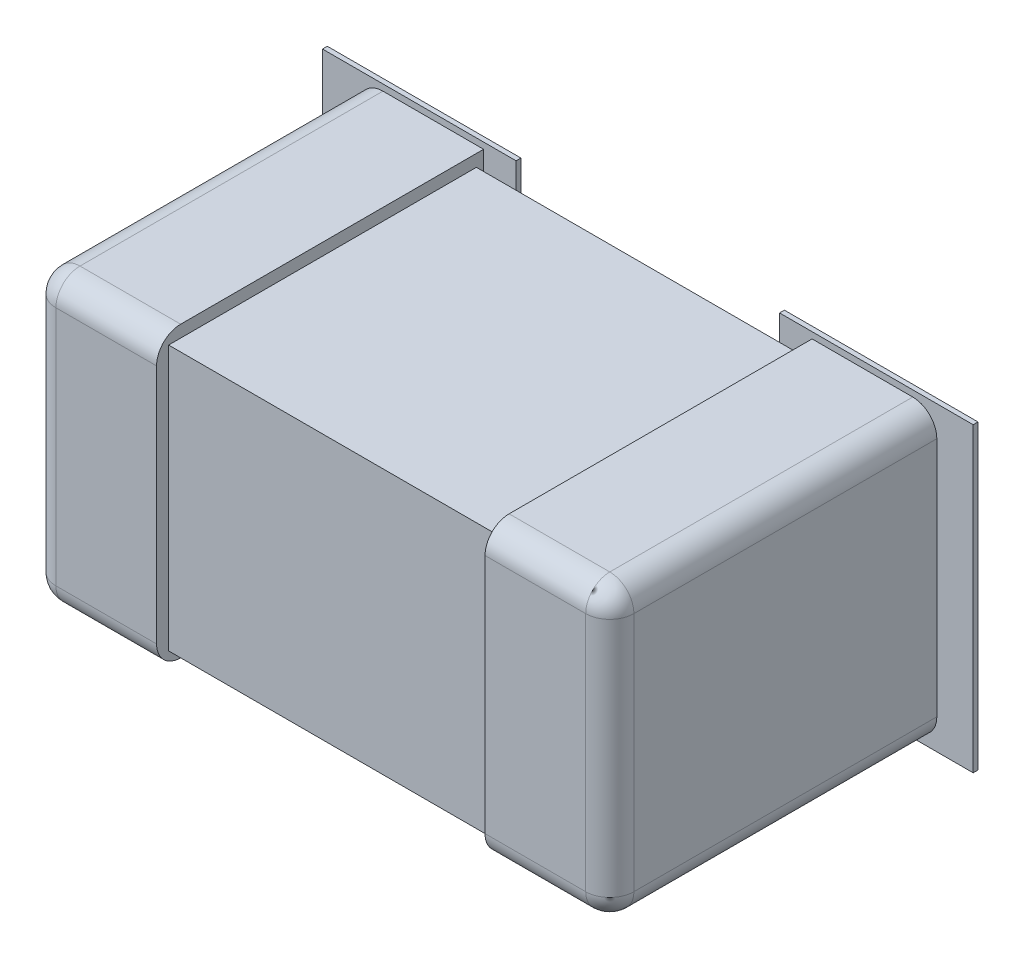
ISO-10303-21;
HEADER;
FILE_DESCRIPTION(('STEP AP214'),'2;1');
FILE_NAME('part.step','',(''),(''),'','','');
FILE_SCHEMA(('AUTOMOTIVE_DESIGN { 1 0 10303 214 1 1 1 1 }'));
ENDSEC;
DATA;
#1=APPLICATION_CONTEXT('core data for automotive mechanical design processes');
#2=APPLICATION_PROTOCOL_DEFINITION('international standard','automotive_design',2000,#1);
#3=PRODUCT_CONTEXT('',#1,'mechanical');
#4=PRODUCT('Part','Part','',(#3));
#5=PRODUCT_RELATED_PRODUCT_CATEGORY('part','',(#4));
#6=PRODUCT_DEFINITION_FORMATION('','',#4);
#7=PRODUCT_DEFINITION_CONTEXT('part definition',#1,'design');
#8=PRODUCT_DEFINITION('design','',#6,#7);
#9=PRODUCT_DEFINITION_SHAPE('','',#8);
#10=(LENGTH_UNIT() NAMED_UNIT(*) SI_UNIT(.MILLI.,.METRE.));
#11=(NAMED_UNIT(*) PLANE_ANGLE_UNIT() SI_UNIT($,.RADIAN.));
#12=(NAMED_UNIT(*) SI_UNIT($,.STERADIAN.) SOLID_ANGLE_UNIT());
#13=UNCERTAINTY_MEASURE_WITH_UNIT(LENGTH_MEASURE(1.E-05),#10,'distance_accuracy_value','');
#14=(GEOMETRIC_REPRESENTATION_CONTEXT(3) GLOBAL_UNCERTAINTY_ASSIGNED_CONTEXT((#13)) GLOBAL_UNIT_ASSIGNED_CONTEXT((#10,
#11,#12)) REPRESENTATION_CONTEXT('',''));
#15=CARTESIAN_POINT('',(0.,0.,0.));
#16=DIRECTION('',(0.,0.,1.));
#17=DIRECTION('',(1.,0.,0.));
#18=AXIS2_PLACEMENT_3D('',#15,#16,#17);
#19=CARTESIAN_POINT('',(0.,0.,0.0762));
#20=DIRECTION('',(0.,0.,1.));
#21=DIRECTION('',(1.,0.,0.));
#22=AXIS2_PLACEMENT_3D('',#19,#20,#21);
#23=PLANE('',#22);
#24=DIRECTION('',(1.,0.,0.));
#25=VECTOR('',#24,1.);
#26=CARTESIAN_POINT('',(0.138938,-0.159004,0.0762));
#27=LINE('',#26,#25);
#28=CARTESIAN_POINT('',(0.138938,-0.159004,0.0762));
#29=VERTEX_POINT('',#28);
#30=CARTESIAN_POINT('',(0.343154,-0.159004,0.0762));
#31=VERTEX_POINT('',#30);
#32=EDGE_CURVE('E330',#29,#31,#27,.T.);
#33=ORIENTED_EDGE('',*,*,#32,.F.);
#34=DIRECTION('',(0.,1.,0.));
#35=VECTOR('',#34,1.);
#36=CARTESIAN_POINT('',(0.138938,0.159004,0.0762));
#37=LINE('',#36,#35);
#38=CARTESIAN_POINT('',(0.138938,0.159004,0.0762));
#39=VERTEX_POINT('',#38);
#40=EDGE_CURVE('E335',#39,#29,#37,.F.);
#41=ORIENTED_EDGE('',*,*,#40,.F.);
#42=DIRECTION('',(1.,0.,0.));
#43=VECTOR('',#42,1.);
#44=CARTESIAN_POINT('',(0.343154,0.159004,0.0762));
#45=LINE('',#44,#43);
#46=CARTESIAN_POINT('',(0.343154,0.159004,0.0762));
#47=VERTEX_POINT('',#46);
#48=EDGE_CURVE('E319',#47,#39,#45,.F.);
#49=ORIENTED_EDGE('',*,*,#48,.F.);
#50=DIRECTION('',(0.,1.,0.));
#51=VECTOR('',#50,1.);
#52=CARTESIAN_POINT('',(0.343154,-0.159004,0.0762));
#53=LINE('',#52,#51);
#54=EDGE_CURVE('E95',#31,#47,#53,.T.);
#55=ORIENTED_EDGE('',*,*,#54,.F.);
#56=EDGE_LOOP('',(#33,#41,#49,#55));
#57=FACE_BOUND('',#56,.T.);
#58=ADVANCED_FACE('F16',(#57),#23,.F.);
#59=CARTESIAN_POINT('',(0.,0.,0.0762));
#60=DIRECTION('',(0.,0.,1.));
#61=DIRECTION('',(1.,0.,0.));
#62=AXIS2_PLACEMENT_3D('',#59,#60,#61);
#63=PLANE('',#62);
#64=DIRECTION('',(1.,0.,0.));
#65=VECTOR('',#64,1.);
#66=CARTESIAN_POINT('',(-0.138938,0.159004,0.0762));
#67=LINE('',#66,#65);
#68=CARTESIAN_POINT('',(-0.138938,0.159004,0.0762));
#69=VERTEX_POINT('',#68);
#70=CARTESIAN_POINT('',(-0.343154,0.159004,0.0762));
#71=VERTEX_POINT('',#70);
#72=EDGE_CURVE('E278',#69,#71,#67,.F.);
#73=ORIENTED_EDGE('',*,*,#72,.F.);
#74=DIRECTION('',(0.,1.,0.));
#75=VECTOR('',#74,1.);
#76=CARTESIAN_POINT('',(-0.138938,-0.159004,0.0762));
#77=LINE('',#76,#75);
#78=CARTESIAN_POINT('',(-0.138938,-0.159004,0.0762));
#79=VERTEX_POINT('',#78);
#80=EDGE_CURVE('E284',#79,#69,#77,.T.);
#81=ORIENTED_EDGE('',*,*,#80,.F.);
#82=DIRECTION('',(1.,0.,0.));
#83=VECTOR('',#82,1.);
#84=CARTESIAN_POINT('',(-0.343154,-0.159004,0.0762));
#85=LINE('',#84,#83);
#86=CARTESIAN_POINT('',(-0.343154,-0.159004,0.0762));
#87=VERTEX_POINT('',#86);
#88=EDGE_CURVE('E263',#87,#79,#85,.T.);
#89=ORIENTED_EDGE('',*,*,#88,.F.);
#90=DIRECTION('',(0.,1.,0.));
#91=VECTOR('',#90,1.);
#92=CARTESIAN_POINT('',(-0.343154,0.159004,0.0762));
#93=LINE('',#92,#91);
#94=EDGE_CURVE('E272',#71,#87,#93,.F.);
#95=ORIENTED_EDGE('',*,*,#94,.F.);
#96=EDGE_LOOP('',(#73,#81,#89,#95));
#97=FACE_BOUND('',#96,.T.);
#98=ADVANCED_FACE('F663',(#97),#63,.F.);
#99=CARTESIAN_POINT('',(0.138938,0.159004,0.0762));
#100=DIRECTION('',(-1.,0.,0.));
#101=DIRECTION('',(0.,0.,1.));
#102=AXIS2_PLACEMENT_3D('',#99,#100,#101);
#103=PLANE('',#102);
#104=DIRECTION('',(0.,0.,1.));
#105=VECTOR('',#104,1.);
#106=CARTESIAN_POINT('',(0.138938,0.159004,0.0762));
#107=LINE('',#106,#105);
#108=CARTESIAN_POINT('',(0.138938,0.159004,0.08128));
#109=VERTEX_POINT('',#108);
#110=EDGE_CURVE('E324',#39,#109,#107,.T.);
#111=ORIENTED_EDGE('',*,*,#110,.F.);
#112=ORIENTED_EDGE('',*,*,#40,.T.);
#113=DIRECTION('',(0.,0.,-1.));
#114=VECTOR('',#113,1.);
#115=CARTESIAN_POINT('',(0.138938,-0.159004,0.0762));
#116=LINE('',#115,#114);
#117=CARTESIAN_POINT('',(0.138938,-0.159004,0.08128));
#118=VERTEX_POINT('',#117);
#119=EDGE_CURVE('E332',#118,#29,#116,.T.);
#120=ORIENTED_EDGE('',*,*,#119,.F.);
#121=DIRECTION('',(0.,1.,0.));
#122=VECTOR('',#121,1.);
#123=CARTESIAN_POINT('',(0.138938,0.,0.08128));
#124=LINE('',#123,#122);
#125=EDGE_CURVE('E216',#109,#118,#124,.F.);
#126=ORIENTED_EDGE('',*,*,#125,.F.);
#127=EDGE_LOOP('',(#111,#112,#120,#126));
#128=FACE_BOUND('',#127,.T.);
#129=ADVANCED_FACE('F669',(#128),#103,.T.);
#130=CARTESIAN_POINT('',(0.138938,-0.159004,0.0762));
#131=DIRECTION('',(0.,-1.,0.));
#132=DIRECTION('',(0.,0.,-1.));
#133=AXIS2_PLACEMENT_3D('',#130,#131,#132);
#134=PLANE('',#133);
#135=ORIENTED_EDGE('',*,*,#119,.T.);
#136=ORIENTED_EDGE('',*,*,#32,.T.);
#137=DIRECTION('',(0.,0.,-1.));
#138=VECTOR('',#137,1.);
#139=CARTESIAN_POINT('',(0.343154,-0.159004,0.0762));
#140=LINE('',#139,#138);
#141=CARTESIAN_POINT('',(0.343154,-0.159004,0.08128));
#142=VERTEX_POINT('',#141);
#143=EDGE_CURVE('E328',#142,#31,#140,.T.);
#144=ORIENTED_EDGE('',*,*,#143,.F.);
#145=DIRECTION('',(1.,0.,0.));
#146=VECTOR('',#145,1.);
#147=CARTESIAN_POINT('',(0.,-0.159004,0.08128));
#148=LINE('',#147,#146);
#149=EDGE_CURVE('E213',#118,#142,#148,.T.);
#150=ORIENTED_EDGE('',*,*,#149,.F.);
#151=EDGE_LOOP('',(#135,#136,#144,#150));
#152=FACE_BOUND('',#151,.T.);
#153=ADVANCED_FACE('F714',(#152),#134,.T.);
#154=CARTESIAN_POINT('',(0.343154,-0.159004,0.0762));
#155=DIRECTION('',(1.,0.,0.));
#156=DIRECTION('',(0.,0.,-1.));
#157=AXIS2_PLACEMENT_3D('',#154,#155,#156);
#158=PLANE('',#157);
#159=ORIENTED_EDGE('',*,*,#143,.T.);
#160=ORIENTED_EDGE('',*,*,#54,.T.);
#161=DIRECTION('',(0.,0.,1.));
#162=VECTOR('',#161,1.);
#163=CARTESIAN_POINT('',(0.343154,0.159004,0.0762));
#164=LINE('',#163,#162);
#165=CARTESIAN_POINT('',(0.343154,0.159004,0.08128));
#166=VERTEX_POINT('',#165);
#167=EDGE_CURVE('E322',#166,#47,#164,.F.);
#168=ORIENTED_EDGE('',*,*,#167,.F.);
#169=DIRECTION('',(0.,1.,0.));
#170=VECTOR('',#169,1.);
#171=CARTESIAN_POINT('',(0.343154,0.,0.08128));
#172=LINE('',#171,#170);
#173=EDGE_CURVE('E210',#142,#166,#172,.T.);
#174=ORIENTED_EDGE('',*,*,#173,.F.);
#175=EDGE_LOOP('',(#159,#160,#168,#174));
#176=FACE_BOUND('',#175,.T.);
#177=ADVANCED_FACE('F721',(#176),#158,.T.);
#178=CARTESIAN_POINT('',(0.343154,0.159004,0.0762));
#179=DIRECTION('',(0.,1.,0.));
#180=DIRECTION('',(0.,0.,1.));
#181=AXIS2_PLACEMENT_3D('',#178,#179,#180);
#182=PLANE('',#181);
#183=ORIENTED_EDGE('',*,*,#167,.T.);
#184=ORIENTED_EDGE('',*,*,#48,.T.);
#185=ORIENTED_EDGE('',*,*,#110,.T.);
#186=DIRECTION('',(1.,0.,0.));
#187=VECTOR('',#186,1.);
#188=CARTESIAN_POINT('',(0.,0.159004,0.08128));
#189=LINE('',#188,#187);
#190=EDGE_CURVE('E207',#166,#109,#189,.F.);
#191=ORIENTED_EDGE('',*,*,#190,.F.);
#192=EDGE_LOOP('',(#183,#184,#185,#191));
#193=FACE_BOUND('',#192,.T.);
#194=ADVANCED_FACE('F729',(#193),#182,.T.);
#195=CARTESIAN_POINT('',(0.3048,-0.1524,0.0762));
#196=DIRECTION('',(1.,0.,0.));
#197=DIRECTION('',(0.,0.,-1.));
#198=AXIS2_PLACEMENT_3D('',#195,#196,#197);
#199=PLANE('',#198);
#200=DIRECTION('',(0.,0.,-1.));
#201=VECTOR('',#200,1.);
#202=CARTESIAN_POINT('',(0.3048,-0.127,0.8824876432));
#203=LINE('',#202,#201);
#204=CARTESIAN_POINT('',(0.3048,-0.127,0.08128));
#205=VERTEX_POINT('',#204);
#206=CARTESIAN_POINT('',(0.3048,-0.127,0.400812));
#207=VERTEX_POINT('',#206);
#208=EDGE_CURVE('E315',#205,#207,#203,.F.);
#209=ORIENTED_EDGE('',*,*,#208,.F.);
#210=DIRECTION('',(0.,1.,0.));
#211=VECTOR('',#210,1.);
#212=CARTESIAN_POINT('',(0.3048,0.,0.08128));
#213=LINE('',#212,#211);
#214=CARTESIAN_POINT('',(0.3048,0.127,0.08128));
#215=VERTEX_POINT('',#214);
#216=EDGE_CURVE('E205',#215,#205,#213,.F.);
#217=ORIENTED_EDGE('',*,*,#216,.F.);
#218=DIRECTION('',(0.,0.,-1.));
#219=VECTOR('',#218,1.);
#220=CARTESIAN_POINT('',(0.3048,0.127,0.8824876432));
#221=LINE('',#220,#219);
#222=CARTESIAN_POINT('',(0.3048,0.127,0.400812));
#223=VERTEX_POINT('',#222);
#224=EDGE_CURVE('E86',#223,#215,#221,.T.);
#225=ORIENTED_EDGE('',*,*,#224,.F.);
#226=DIRECTION('',(0.,1.,0.));
#227=VECTOR('',#226,1.);
#228=CARTESIAN_POINT('',(0.3048,-0.5735592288,0.400812));
#229=LINE('',#228,#227);
#230=EDGE_CURVE('E341',#207,#223,#229,.T.);
#231=ORIENTED_EDGE('',*,*,#230,.F.);
#232=EDGE_LOOP('',(#209,#217,#225,#231));
#233=FACE_BOUND('',#232,.T.);
#234=ADVANCED_FACE('F736',(#233),#199,.T.);
#235=CARTESIAN_POINT('',(0.2794,0.127,0.8824876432));
#236=DIRECTION('',(0.,0.,-1.));
#237=DIRECTION('',(-1.,0.,0.));
#238=AXIS2_PLACEMENT_3D('',#235,#236,#237);
#239=CYLINDRICAL_SURFACE('',#238,0.0254);
#240=ORIENTED_EDGE('',*,*,#224,.T.);
#241=CARTESIAN_POINT('',(0.2794,0.127,0.08128));
#242=DIRECTION('',(0.,0.,-1.));
#243=DIRECTION('',(-1.,0.,0.));
#244=AXIS2_PLACEMENT_3D('',#241,#242,#243);
#245=CIRCLE('',#244,0.0254);
#246=CARTESIAN_POINT('',(0.2794,0.1524,0.08128));
#247=VERTEX_POINT('',#246);
#248=EDGE_CURVE('E185',#247,#215,#245,.T.);
#249=ORIENTED_EDGE('',*,*,#248,.F.);
#250=DIRECTION('',(0.,0.,1.));
#251=VECTOR('',#250,1.);
#252=CARTESIAN_POINT('',(0.2794,0.1524,0.0762));
#253=LINE('',#252,#251);
#254=CARTESIAN_POINT('',(0.2794,0.1524,0.400812));
#255=VERTEX_POINT('',#254);
#256=EDGE_CURVE('E162',#255,#247,#253,.F.);
#257=ORIENTED_EDGE('',*,*,#256,.F.);
#258=CARTESIAN_POINT('',(0.2794,0.127,0.400812));
#259=DIRECTION('',(0.,0.,-1.));
#260=DIRECTION('',(-1.,0.,0.));
#261=AXIS2_PLACEMENT_3D('',#258,#259,#260);
#262=CIRCLE('',#261,0.0254);
#263=EDGE_CURVE('E19',#223,#255,#262,.F.);
#264=ORIENTED_EDGE('',*,*,#263,.F.);
#265=EDGE_LOOP('',(#240,#249,#257,#264));
#266=FACE_BOUND('',#265,.T.);
#267=ADVANCED_FACE('F183',(#266),#239,.T.);
#268=CARTESIAN_POINT('',(0.2794,0.127,0.400812));
#269=DIRECTION('',(0.,0.707106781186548,0.707106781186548));
#270=DIRECTION('',(1.,0.,0.));
#271=AXIS2_PLACEMENT_3D('',#268,#269,#270);
#272=SPHERICAL_SURFACE('',#271,0.0254);
#273=CARTESIAN_POINT('',(0.2794,0.127,0.400812));
#274=DIRECTION('',(-1.,0.,0.));
#275=DIRECTION('',(0.,0.,1.));
#276=AXIS2_PLACEMENT_3D('',#273,#274,#275);
#277=CIRCLE('',#276,0.0254);
#278=CARTESIAN_POINT('',(0.2794,0.127,0.426212));
#279=VERTEX_POINT('',#278);
#280=CARTESIAN_POINT('',(0.2794,0.144960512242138,0.418772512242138));
#281=VERTEX_POINT('',#280);
#282=EDGE_CURVE('E181',#279,#281,#277,.T.);
#283=ORIENTED_EDGE('',*,*,#282,.F.);
#284=CARTESIAN_POINT('',(0.2794,0.127,0.400812));
#285=DIRECTION('',(0.,1.,0.));
#286=DIRECTION('',(0.,0.,1.));
#287=AXIS2_PLACEMENT_3D('',#284,#285,#286);
#288=CIRCLE('',#287,0.0254);
#289=EDGE_CURVE('E172',#223,#279,#288,.F.);
#290=ORIENTED_EDGE('',*,*,#289,.F.);
#291=ORIENTED_EDGE('',*,*,#263,.T.);
#292=CARTESIAN_POINT('',(0.2794,0.127,0.400812));
#293=DIRECTION('',(-1.,0.,0.));
#294=DIRECTION('',(0.,0.,1.));
#295=AXIS2_PLACEMENT_3D('',#292,#293,#294);
#296=CIRCLE('',#295,0.0254);
#297=EDGE_CURVE('E171',#281,#255,#296,.T.);
#298=ORIENTED_EDGE('',*,*,#297,.F.);
#299=EDGE_LOOP('',(#283,#290,#291,#298));
#300=FACE_BOUND('',#299,.T.);
#301=ADVANCED_FACE('F170',(#300),#272,.T.);
#302=CARTESIAN_POINT('',(0.2794,-0.5735592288,0.400812));
#303=DIRECTION('',(0.,1.,0.));
#304=DIRECTION('',(0.,0.,1.));
#305=AXIS2_PLACEMENT_3D('',#302,#303,#304);
#306=CYLINDRICAL_SURFACE('',#305,0.0254);
#307=CARTESIAN_POINT('',(0.2794,-0.127,0.400812));
#308=DIRECTION('',(0.,1.,0.));
#309=DIRECTION('',(0.,0.,1.));
#310=AXIS2_PLACEMENT_3D('',#307,#308,#309);
#311=CIRCLE('',#310,0.0254);
#312=CARTESIAN_POINT('',(0.297360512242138,-0.127,0.418772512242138));
#313=VERTEX_POINT('',#312);
#314=EDGE_CURVE('E343',#207,#313,#311,.F.);
#315=ORIENTED_EDGE('',*,*,#314,.F.);
#316=ORIENTED_EDGE('',*,*,#230,.T.);
#317=ORIENTED_EDGE('',*,*,#289,.T.);
#318=DIRECTION('',(0.,1.,0.));
#319=VECTOR('',#318,1.);
#320=CARTESIAN_POINT('',(0.2794,0.,0.426212));
#321=LINE('',#320,#319);
#322=CARTESIAN_POINT('',(0.2794,-0.127,0.426212));
#323=VERTEX_POINT('',#322);
#324=EDGE_CURVE('E194',#323,#279,#321,.T.);
#325=ORIENTED_EDGE('',*,*,#324,.F.);
#326=CARTESIAN_POINT('',(0.2794,-0.127,0.400812));
#327=DIRECTION('',(0.,-1.,0.));
#328=DIRECTION('',(0.707106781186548,0.,0.707106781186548));
#329=AXIS2_PLACEMENT_3D('',#326,#327,#328);
#330=CIRCLE('',#329,0.0254);
#331=EDGE_CURVE('E295',#313,#323,#330,.T.);
#332=ORIENTED_EDGE('',*,*,#331,.F.);
#333=EDGE_LOOP('',(#315,#316,#317,#325,#332));
#334=FACE_BOUND('',#333,.T.);
#335=ADVANCED_FACE('F303',(#334),#306,.T.);
#336=CARTESIAN_POINT('',(0.2794,-0.127,0.400812));
#337=DIRECTION('',(0.707106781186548,0.,0.707106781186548));
#338=DIRECTION('',(0.,-1.,0.));
#339=AXIS2_PLACEMENT_3D('',#336,#337,#338);
#340=SPHERICAL_SURFACE('',#339,0.0254);
#341=ORIENTED_EDGE('',*,*,#331,.T.);
#342=CARTESIAN_POINT('',(0.2794,-0.127,0.400812));
#343=DIRECTION('',(1.,0.,0.));
#344=DIRECTION('',(0.,0.,-1.));
#345=AXIS2_PLACEMENT_3D('',#342,#343,#344);
#346=CIRCLE('',#345,0.0254);
#347=CARTESIAN_POINT('',(0.2794,-0.1524,0.400812));
#348=VERTEX_POINT('',#347);
#349=EDGE_CURVE('E373',#348,#323,#346,.F.);
#350=ORIENTED_EDGE('',*,*,#349,.F.);
#351=CARTESIAN_POINT('',(0.2794,-0.127,0.400812));
#352=DIRECTION('',(0.,0.,-1.));
#353=DIRECTION('',(-1.,0.,0.));
#354=AXIS2_PLACEMENT_3D('',#351,#352,#353);
#355=CIRCLE('',#354,0.0254);
#356=EDGE_CURVE('E287',#207,#348,#355,.T.);
#357=ORIENTED_EDGE('',*,*,#356,.F.);
#358=ORIENTED_EDGE('',*,*,#314,.T.);
#359=EDGE_LOOP('',(#341,#350,#357,#358));
#360=FACE_BOUND('',#359,.T.);
#361=ADVANCED_FACE('F298',(#360),#340,.T.);
#362=CARTESIAN_POINT('',(0.2794,-0.127,0.8824876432));
#363=DIRECTION('',(0.,0.,-1.));
#364=DIRECTION('',(-1.,0.,0.));
#365=AXIS2_PLACEMENT_3D('',#362,#363,#364);
#366=CYLINDRICAL_SURFACE('',#365,0.0254);
#367=DIRECTION('',(0.,0.,-1.));
#368=VECTOR('',#367,1.);
#369=CARTESIAN_POINT('',(0.2794,-0.1524,0.0762));
#370=LINE('',#369,#368);
#371=CARTESIAN_POINT('',(0.2794,-0.1524,0.08128));
#372=VERTEX_POINT('',#371);
#373=EDGE_CURVE('E288',#372,#348,#370,.F.);
#374=ORIENTED_EDGE('',*,*,#373,.F.);
#375=CARTESIAN_POINT('',(0.2794,-0.127,0.08128));
#376=DIRECTION('',(0.,0.,-1.));
#377=DIRECTION('',(-1.,0.,0.));
#378=AXIS2_PLACEMENT_3D('',#375,#376,#377);
#379=CIRCLE('',#378,0.0254);
#380=EDGE_CURVE('E188',#205,#372,#379,.T.);
#381=ORIENTED_EDGE('',*,*,#380,.F.);
#382=ORIENTED_EDGE('',*,*,#208,.T.);
#383=ORIENTED_EDGE('',*,*,#356,.T.);
#384=EDGE_LOOP('',(#374,#381,#382,#383));
#385=FACE_BOUND('',#384,.T.);
#386=ADVANCED_FACE('F302',(#385),#366,.T.);
#387=CARTESIAN_POINT('',(-0.138938,-0.159004,0.0762));
#388=DIRECTION('',(1.,0.,0.));
#389=DIRECTION('',(0.,0.,-1.));
#390=AXIS2_PLACEMENT_3D('',#387,#388,#389);
#391=PLANE('',#390);
#392=DIRECTION('',(0.,0.,-1.));
#393=VECTOR('',#392,1.);
#394=CARTESIAN_POINT('',(-0.138938,-0.159004,0.0762));
#395=LINE('',#394,#393);
#396=CARTESIAN_POINT('',(-0.138938,-0.159004,0.08128));
#397=VERTEX_POINT('',#396);
#398=EDGE_CURVE('E269',#79,#397,#395,.F.);
#399=ORIENTED_EDGE('',*,*,#398,.F.);
#400=ORIENTED_EDGE('',*,*,#80,.T.);
#401=DIRECTION('',(0.,0.,1.));
#402=VECTOR('',#401,1.);
#403=CARTESIAN_POINT('',(-0.138938,0.159004,0.0762));
#404=LINE('',#403,#402);
#405=CARTESIAN_POINT('',(-0.138938,0.159004,0.08128));
#406=VERTEX_POINT('',#405);
#407=EDGE_CURVE('E281',#406,#69,#404,.F.);
#408=ORIENTED_EDGE('',*,*,#407,.F.);
#409=DIRECTION('',(0.,1.,0.));
#410=VECTOR('',#409,1.);
#411=CARTESIAN_POINT('',(-0.138938,0.,0.08128));
#412=LINE('',#411,#410);
#413=EDGE_CURVE('E438',#397,#406,#412,.T.);
#414=ORIENTED_EDGE('',*,*,#413,.F.);
#415=EDGE_LOOP('',(#399,#400,#408,#414));
#416=FACE_BOUND('',#415,.T.);
#417=ADVANCED_FACE('F766',(#416),#391,.T.);
#418=CARTESIAN_POINT('',(-0.138938,0.159004,0.0762));
#419=DIRECTION('',(0.,1.,0.));
#420=DIRECTION('',(0.,0.,1.));
#421=AXIS2_PLACEMENT_3D('',#418,#419,#420);
#422=PLANE('',#421);
#423=ORIENTED_EDGE('',*,*,#407,.T.);
#424=ORIENTED_EDGE('',*,*,#72,.T.);
#425=DIRECTION('',(0.,0.,1.));
#426=VECTOR('',#425,1.);
#427=CARTESIAN_POINT('',(-0.343154,0.159004,0.0762));
#428=LINE('',#427,#426);
#429=CARTESIAN_POINT('',(-0.343154,0.159004,0.08128));
#430=VERTEX_POINT('',#429);
#431=EDGE_CURVE('E275',#430,#71,#428,.F.);
#432=ORIENTED_EDGE('',*,*,#431,.F.);
#433=DIRECTION('',(1.,0.,0.));
#434=VECTOR('',#433,1.);
#435=CARTESIAN_POINT('',(0.,0.159004,0.08128));
#436=LINE('',#435,#434);
#437=EDGE_CURVE('E435',#406,#430,#436,.F.);
#438=ORIENTED_EDGE('',*,*,#437,.F.);
#439=EDGE_LOOP('',(#423,#424,#432,#438));
#440=FACE_BOUND('',#439,.T.);
#441=ADVANCED_FACE('F772',(#440),#422,.T.);
#442=CARTESIAN_POINT('',(-0.343154,0.159004,0.0762));
#443=DIRECTION('',(-1.,0.,0.));
#444=DIRECTION('',(0.,0.,1.));
#445=AXIS2_PLACEMENT_3D('',#442,#443,#444);
#446=PLANE('',#445);
#447=ORIENTED_EDGE('',*,*,#431,.T.);
#448=ORIENTED_EDGE('',*,*,#94,.T.);
#449=DIRECTION('',(0.,0.,-1.));
#450=VECTOR('',#449,1.);
#451=CARTESIAN_POINT('',(-0.343154,-0.159004,0.0762));
#452=LINE('',#451,#450);
#453=CARTESIAN_POINT('',(-0.343154,-0.159004,0.08128));
#454=VERTEX_POINT('',#453);
#455=EDGE_CURVE('E266',#454,#87,#452,.T.);
#456=ORIENTED_EDGE('',*,*,#455,.F.);
#457=DIRECTION('',(0.,1.,0.));
#458=VECTOR('',#457,1.);
#459=CARTESIAN_POINT('',(-0.343154,0.,0.08128));
#460=LINE('',#459,#458);
#461=EDGE_CURVE('E432',#430,#454,#460,.F.);
#462=ORIENTED_EDGE('',*,*,#461,.F.);
#463=EDGE_LOOP('',(#447,#448,#456,#462));
#464=FACE_BOUND('',#463,.T.);
#465=ADVANCED_FACE('F779',(#464),#446,.T.);
#466=CARTESIAN_POINT('',(-0.343154,-0.159004,0.0762));
#467=DIRECTION('',(0.,-1.,0.));
#468=DIRECTION('',(0.,0.,-1.));
#469=AXIS2_PLACEMENT_3D('',#466,#467,#468);
#470=PLANE('',#469);
#471=ORIENTED_EDGE('',*,*,#455,.T.);
#472=ORIENTED_EDGE('',*,*,#88,.T.);
#473=ORIENTED_EDGE('',*,*,#398,.T.);
#474=DIRECTION('',(1.,0.,0.));
#475=VECTOR('',#474,1.);
#476=CARTESIAN_POINT('',(0.,-0.159004,0.08128));
#477=LINE('',#476,#475);
#478=EDGE_CURVE('E372',#454,#397,#477,.T.);
#479=ORIENTED_EDGE('',*,*,#478,.F.);
#480=EDGE_LOOP('',(#471,#472,#473,#479));
#481=FACE_BOUND('',#480,.T.);
#482=ADVANCED_FACE('F787',(#481),#470,.T.);
#483=CARTESIAN_POINT('',(-0.3048,0.1524,0.0762));
#484=DIRECTION('',(-1.,0.,0.));
#485=DIRECTION('',(0.,0.,1.));
#486=AXIS2_PLACEMENT_3D('',#483,#484,#485);
#487=PLANE('',#486);
#488=DIRECTION('',(0.,0.,-1.));
#489=VECTOR('',#488,1.);
#490=CARTESIAN_POINT('',(-0.3048,0.127,0.8824876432));
#491=LINE('',#490,#489);
#492=CARTESIAN_POINT('',(-0.3048,0.127,0.08128));
#493=VERTEX_POINT('',#492);
#494=CARTESIAN_POINT('',(-0.3048,0.127,0.400812));
#495=VERTEX_POINT('',#494);
#496=EDGE_CURVE('E226',#493,#495,#491,.F.);
#497=ORIENTED_EDGE('',*,*,#496,.F.);
#498=DIRECTION('',(0.,1.,0.));
#499=VECTOR('',#498,1.);
#500=CARTESIAN_POINT('',(-0.3048,0.,0.08128));
#501=LINE('',#500,#499);
#502=CARTESIAN_POINT('',(-0.3048,-0.127,0.08128));
#503=VERTEX_POINT('',#502);
#504=EDGE_CURVE('E368',#503,#493,#501,.T.);
#505=ORIENTED_EDGE('',*,*,#504,.F.);
#506=DIRECTION('',(0.,0.,-1.));
#507=VECTOR('',#506,1.);
#508=CARTESIAN_POINT('',(-0.3048,-0.127,0.8824876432));
#509=LINE('',#508,#507);
#510=CARTESIAN_POINT('',(-0.3048,-0.127,0.400812));
#511=VERTEX_POINT('',#510);
#512=EDGE_CURVE('E260',#511,#503,#509,.T.);
#513=ORIENTED_EDGE('',*,*,#512,.F.);
#514=DIRECTION('',(0.,-1.,0.));
#515=VECTOR('',#514,1.);
#516=CARTESIAN_POINT('',(-0.3048,0.5735592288,0.400812));
#517=LINE('',#516,#515);
#518=EDGE_CURVE('E337',#495,#511,#517,.T.);
#519=ORIENTED_EDGE('',*,*,#518,.F.);
#520=EDGE_LOOP('',(#497,#505,#513,#519));
#521=FACE_BOUND('',#520,.T.);
#522=ADVANCED_FACE('F795',(#521),#487,.T.);
#523=CARTESIAN_POINT('',(-0.2794,-0.127,0.8824876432));
#524=DIRECTION('',(0.,0.,-1.));
#525=DIRECTION('',(-1.,0.,0.));
#526=AXIS2_PLACEMENT_3D('',#523,#524,#525);
#527=CYLINDRICAL_SURFACE('',#526,0.0254);
#528=ORIENTED_EDGE('',*,*,#512,.T.);
#529=CARTESIAN_POINT('',(-0.2794,-0.127,0.08128));
#530=DIRECTION('',(0.,0.,-1.));
#531=DIRECTION('',(-1.,0.,0.));
#532=AXIS2_PLACEMENT_3D('',#529,#530,#531);
#533=CIRCLE('',#532,0.0254);
#534=CARTESIAN_POINT('',(-0.2794,-0.1524,0.08128));
#535=VERTEX_POINT('',#534);
#536=EDGE_CURVE('E369',#535,#503,#533,.T.);
#537=ORIENTED_EDGE('',*,*,#536,.F.);
#538=DIRECTION('',(0.,0.,-1.));
#539=VECTOR('',#538,1.);
#540=CARTESIAN_POINT('',(-0.2794,-0.1524,0.0762));
#541=LINE('',#540,#539);
#542=CARTESIAN_POINT('',(-0.2794,-0.1524,0.400812));
#543=VERTEX_POINT('',#542);
#544=EDGE_CURVE('E257',#543,#535,#541,.T.);
#545=ORIENTED_EDGE('',*,*,#544,.F.);
#546=CARTESIAN_POINT('',(-0.2794,-0.127,0.400812));
#547=DIRECTION('',(0.,0.,-1.));
#548=DIRECTION('',(-1.,0.,0.));
#549=AXIS2_PLACEMENT_3D('',#546,#547,#548);
#550=CIRCLE('',#549,0.0254);
#551=EDGE_CURVE('E262',#511,#543,#550,.F.);
#552=ORIENTED_EDGE('',*,*,#551,.F.);
#553=EDGE_LOOP('',(#528,#537,#545,#552));
#554=FACE_BOUND('',#553,.T.);
#555=ADVANCED_FACE('F252',(#554),#527,.T.);
#556=CARTESIAN_POINT('',(-0.2794,-0.127,0.400812));
#557=DIRECTION('',(0.,-0.707106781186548,0.707106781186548));
#558=DIRECTION('',(-1.,0.,0.));
#559=AXIS2_PLACEMENT_3D('',#556,#557,#558);
#560=SPHERICAL_SURFACE('',#559,0.0254);
#561=CARTESIAN_POINT('',(-0.2794,-0.127,0.400812));
#562=DIRECTION('',(1.,0.,0.));
#563=DIRECTION('',(0.,0.,-1.));
#564=AXIS2_PLACEMENT_3D('',#561,#562,#563);
#565=CIRCLE('',#564,0.0254);
#566=CARTESIAN_POINT('',(-0.2794,-0.127,0.426212));
#567=VERTEX_POINT('',#566);
#568=CARTESIAN_POINT('',(-0.2794,-0.144960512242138,0.418772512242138));
#569=VERTEX_POINT('',#568);
#570=EDGE_CURVE('E234',#567,#569,#565,.T.);
#571=ORIENTED_EDGE('',*,*,#570,.F.);
#572=CARTESIAN_POINT('',(-0.2794,-0.127,0.400812));
#573=DIRECTION('',(0.,-1.,0.));
#574=DIRECTION('',(0.,0.,-1.));
#575=AXIS2_PLACEMENT_3D('',#572,#573,#574);
#576=CIRCLE('',#575,0.0254);
#577=EDGE_CURVE('E340',#511,#567,#576,.F.);
#578=ORIENTED_EDGE('',*,*,#577,.F.);
#579=ORIENTED_EDGE('',*,*,#551,.T.);
#580=CARTESIAN_POINT('',(-0.2794,-0.127,0.400812));
#581=DIRECTION('',(1.,0.,0.));
#582=DIRECTION('',(0.,0.,-1.));
#583=AXIS2_PLACEMENT_3D('',#580,#581,#582);
#584=CIRCLE('',#583,0.0254);
#585=EDGE_CURVE('E363',#569,#543,#584,.T.);
#586=ORIENTED_EDGE('',*,*,#585,.F.);
#587=EDGE_LOOP('',(#571,#578,#579,#586));
#588=FACE_BOUND('',#587,.T.);
#589=ADVANCED_FACE('F247',(#588),#560,.T.);
#590=CARTESIAN_POINT('',(-0.2794,0.5735592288,0.400812));
#591=DIRECTION('',(0.,-1.,0.));
#592=DIRECTION('',(0.,0.,-1.));
#593=AXIS2_PLACEMENT_3D('',#590,#591,#592);
#594=CYLINDRICAL_SURFACE('',#593,0.0254);
#595=CARTESIAN_POINT('',(-0.2794,0.127,0.400812));
#596=DIRECTION('',(0.,-1.,0.));
#597=DIRECTION('',(0.,0.,-1.));
#598=AXIS2_PLACEMENT_3D('',#595,#596,#597);
#599=CIRCLE('',#598,0.0254);
#600=CARTESIAN_POINT('',(-0.2794,0.127,0.426212));
#601=VERTEX_POINT('',#600);
#602=EDGE_CURVE('E259',#495,#601,#599,.F.);
#603=ORIENTED_EDGE('',*,*,#602,.F.);
#604=ORIENTED_EDGE('',*,*,#518,.T.);
#605=ORIENTED_EDGE('',*,*,#577,.T.);
#606=DIRECTION('',(0.,1.,0.));
#607=VECTOR('',#606,1.);
#608=CARTESIAN_POINT('',(-0.2794,0.,0.426212));
#609=LINE('',#608,#607);
#610=EDGE_CURVE('E227',#601,#567,#609,.F.);
#611=ORIENTED_EDGE('',*,*,#610,.F.);
#612=EDGE_LOOP('',(#603,#604,#605,#611));
#613=FACE_BOUND('',#612,.T.);
#614=ADVANCED_FACE('F242',(#613),#594,.T.);
#615=CARTESIAN_POINT('',(-0.2794,0.127,0.400812));
#616=DIRECTION('',(-0.707106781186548,0.707106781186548,0.));
#617=DIRECTION('',(0.,0.,1.));
#618=AXIS2_PLACEMENT_3D('',#615,#616,#617);
#619=SPHERICAL_SURFACE('',#618,0.0254);
#620=ORIENTED_EDGE('',*,*,#602,.T.);
#621=CARTESIAN_POINT('',(-0.2794,0.127,0.400812));
#622=DIRECTION('',(-1.,0.,0.));
#623=DIRECTION('',(0.,0.,1.));
#624=AXIS2_PLACEMENT_3D('',#621,#622,#623);
#625=CIRCLE('',#624,0.0254);
#626=CARTESIAN_POINT('',(-0.2794,0.1524,0.400812));
#627=VERTEX_POINT('',#626);
#628=EDGE_CURVE('E360',#627,#601,#625,.F.);
#629=ORIENTED_EDGE('',*,*,#628,.F.);
#630=CARTESIAN_POINT('',(-0.2794,0.127,0.400812));
#631=DIRECTION('',(0.,0.,-1.));
#632=DIRECTION('',(-1.,0.,0.));
#633=AXIS2_PLACEMENT_3D('',#630,#631,#632);
#634=CIRCLE('',#633,0.0254);
#635=CARTESIAN_POINT('',(-0.297360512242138,0.144960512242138,0.400812));
#636=VERTEX_POINT('',#635);
#637=EDGE_CURVE('E219',#636,#627,#634,.T.);
#638=ORIENTED_EDGE('',*,*,#637,.F.);
#639=CARTESIAN_POINT('',(-0.2794,0.127,0.400812));
#640=DIRECTION('',(0.,0.,-1.));
#641=DIRECTION('',(-1.,0.,0.));
#642=AXIS2_PLACEMENT_3D('',#639,#640,#641);
#643=CIRCLE('',#642,0.0254);
#644=EDGE_CURVE('E34',#495,#636,#643,.T.);
#645=ORIENTED_EDGE('',*,*,#644,.F.);
#646=EDGE_LOOP('',(#620,#629,#638,#645));
#647=FACE_BOUND('',#646,.T.);
#648=ADVANCED_FACE('F237',(#647),#619,.T.);
#649=CARTESIAN_POINT('',(-0.2794,0.127,0.8824876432));
#650=DIRECTION('',(0.,0.,-1.));
#651=DIRECTION('',(-1.,0.,0.));
#652=AXIS2_PLACEMENT_3D('',#649,#650,#651);
#653=CYLINDRICAL_SURFACE('',#652,0.0254);
#654=DIRECTION('',(0.,0.,1.));
#655=VECTOR('',#654,1.);
#656=CARTESIAN_POINT('',(-0.2794,0.1524,0.0762));
#657=LINE('',#656,#655);
#658=CARTESIAN_POINT('',(-0.2794,0.1524,0.08128));
#659=VERTEX_POINT('',#658);
#660=EDGE_CURVE('E220',#659,#627,#657,.T.);
#661=ORIENTED_EDGE('',*,*,#660,.F.);
#662=CARTESIAN_POINT('',(-0.2794,0.127,0.08128));
#663=DIRECTION('',(0.,0.,-1.));
#664=DIRECTION('',(-1.,0.,0.));
#665=AXIS2_PLACEMENT_3D('',#662,#663,#664);
#666=CIRCLE('',#665,0.0254);
#667=EDGE_CURVE('E366',#493,#659,#666,.T.);
#668=ORIENTED_EDGE('',*,*,#667,.F.);
#669=ORIENTED_EDGE('',*,*,#496,.T.);
#670=ORIENTED_EDGE('',*,*,#644,.T.);
#671=ORIENTED_EDGE('',*,*,#637,.T.);
#672=EDGE_LOOP('',(#661,#668,#669,#670,#671));
#673=FACE_BOUND('',#672,.T.);
#674=ADVANCED_FACE('F241',(#673),#653,.T.);
#675=CARTESIAN_POINT('',(0.,0.,0.08128));
#676=DIRECTION('',(0.,0.,1.));
#677=DIRECTION('',(1.,0.,0.));
#678=AXIS2_PLACEMENT_3D('',#675,#676,#677);
#679=PLANE('',#678);
#680=DIRECTION('',(0.,1.,0.));
#681=VECTOR('',#680,1.);
#682=CARTESIAN_POINT('',(0.173228,-0.1524,0.08128));
#683=LINE('',#682,#681);
#684=CARTESIAN_POINT('',(0.173228,-0.1524,0.08128));
#685=VERTEX_POINT('',#684);
#686=CARTESIAN_POINT('',(0.173228,0.1524,0.08128));
#687=VERTEX_POINT('',#686);
#688=EDGE_CURVE('E403',#685,#687,#683,.T.);
#689=ORIENTED_EDGE('',*,*,#688,.T.);
#690=DIRECTION('',(1.,0.,0.));
#691=VECTOR('',#690,1.);
#692=CARTESIAN_POINT('',(0.3048,0.1524,0.08128));
#693=LINE('',#692,#691);
#694=EDGE_CURVE('E187',#247,#687,#693,.F.);
#695=ORIENTED_EDGE('',*,*,#694,.F.);
#696=ORIENTED_EDGE('',*,*,#248,.T.);
#697=ORIENTED_EDGE('',*,*,#216,.T.);
#698=ORIENTED_EDGE('',*,*,#380,.T.);
#699=DIRECTION('',(1.,0.,0.));
#700=VECTOR('',#699,1.);
#701=CARTESIAN_POINT('',(-0.3048,-0.1524,0.08128));
#702=LINE('',#701,#700);
#703=EDGE_CURVE('E441',#685,#372,#702,.T.);
#704=ORIENTED_EDGE('',*,*,#703,.F.);
#705=EDGE_LOOP('',(#689,#695,#696,#697,#698,#704));
#706=FACE_BOUND('',#705,.T.);
#707=ORIENTED_EDGE('',*,*,#173,.T.);
#708=ORIENTED_EDGE('',*,*,#190,.T.);
#709=ORIENTED_EDGE('',*,*,#125,.T.);
#710=ORIENTED_EDGE('',*,*,#149,.T.);
#711=EDGE_LOOP('',(#707,#708,#709,#710));
#712=FACE_BOUND('',#711,.T.);
#713=ADVANCED_FACE('F463',(#706,#712),#679,.T.);
#714=CARTESIAN_POINT('',(0.3048,0.1524,0.0762));
#715=DIRECTION('',(0.,1.,0.));
#716=DIRECTION('',(0.,0.,1.));
#717=AXIS2_PLACEMENT_3D('',#714,#715,#716);
#718=PLANE('',#717);
#719=ORIENTED_EDGE('',*,*,#256,.T.);
#720=ORIENTED_EDGE('',*,*,#694,.T.);
#721=DIRECTION('',(0.,0.,-1.));
#722=VECTOR('',#721,1.);
#723=CARTESIAN_POINT('',(0.173228,0.1524,0.0889));
#724=LINE('',#723,#722);
#725=CARTESIAN_POINT('',(0.173228,0.1524,0.400812));
#726=VERTEX_POINT('',#725);
#727=EDGE_CURVE('E193',#687,#726,#724,.F.);
#728=ORIENTED_EDGE('',*,*,#727,.T.);
#729=DIRECTION('',(-1.,0.,0.));
#730=VECTOR('',#729,1.);
#731=CARTESIAN_POINT('',(1.2378251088,0.1524,0.400812));
#732=LINE('',#731,#730);
#733=EDGE_CURVE('E178',#255,#726,#732,.T.);
#734=ORIENTED_EDGE('',*,*,#733,.F.);
#735=EDGE_LOOP('',(#719,#720,#728,#734));
#736=FACE_BOUND('',#735,.T.);
#737=ADVANCED_FACE('F191',(#736),#718,.T.);
#738=CARTESIAN_POINT('',(1.2378251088,0.127,0.400812));
#739=DIRECTION('',(-1.,0.,0.));
#740=DIRECTION('',(0.,0.,1.));
#741=AXIS2_PLACEMENT_3D('',#738,#739,#740);
#742=CYLINDRICAL_SURFACE('',#741,0.0254);
#743=ORIENTED_EDGE('',*,*,#733,.T.);
#744=CARTESIAN_POINT('',(0.173228,0.127,0.400812));
#745=DIRECTION('',(-1.,0.,0.));
#746=DIRECTION('',(0.,0.,1.));
#747=AXIS2_PLACEMENT_3D('',#744,#745,#746);
#748=CIRCLE('',#747,0.0254);
#749=CARTESIAN_POINT('',(0.173228,0.127,0.426212));
#750=VERTEX_POINT('',#749);
#751=EDGE_CURVE('E358',#726,#750,#748,.F.);
#752=ORIENTED_EDGE('',*,*,#751,.T.);
#753=DIRECTION('',(1.,0.,0.));
#754=VECTOR('',#753,1.);
#755=CARTESIAN_POINT('',(0.,0.127,0.426212));
#756=LINE('',#755,#754);
#757=EDGE_CURVE('E197',#279,#750,#756,.F.);
#758=ORIENTED_EDGE('',*,*,#757,.F.);
#759=ORIENTED_EDGE('',*,*,#282,.T.);
#760=ORIENTED_EDGE('',*,*,#297,.T.);
#761=EDGE_LOOP('',(#743,#752,#758,#759,#760));
#762=FACE_BOUND('',#761,.T.);
#763=ADVANCED_FACE('F176',(#762),#742,.T.);
#764=CARTESIAN_POINT('',(0.,0.,0.426212));
#765=DIRECTION('',(0.,0.,1.));
#766=DIRECTION('',(1.,0.,0.));
#767=AXIS2_PLACEMENT_3D('',#764,#765,#766);
#768=PLANE('',#767);
#769=ORIENTED_EDGE('',*,*,#324,.T.);
#770=ORIENTED_EDGE('',*,*,#757,.T.);
#771=DIRECTION('',(0.,1.,0.));
#772=VECTOR('',#771,1.);
#773=CARTESIAN_POINT('',(0.173228,-0.1524,0.426212));
#774=LINE('',#773,#772);
#775=CARTESIAN_POINT('',(0.173228,-0.127,0.426212));
#776=VERTEX_POINT('',#775);
#777=EDGE_CURVE('E357',#750,#776,#774,.F.);
#778=ORIENTED_EDGE('',*,*,#777,.T.);
#779=DIRECTION('',(1.,0.,0.));
#780=VECTOR('',#779,1.);
#781=CARTESIAN_POINT('',(-1.2378251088,-0.127,0.426212));
#782=LINE('',#781,#780);
#783=EDGE_CURVE('E291',#323,#776,#782,.F.);
#784=ORIENTED_EDGE('',*,*,#783,.F.);
#785=EDGE_LOOP('',(#769,#770,#778,#784));
#786=FACE_BOUND('',#785,.T.);
#787=ADVANCED_FACE('F388',(#786),#768,.T.);
#788=CARTESIAN_POINT('',(-1.2378251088,-0.127,0.400812));
#789=DIRECTION('',(1.,0.,0.));
#790=DIRECTION('',(0.,0.,-1.));
#791=AXIS2_PLACEMENT_3D('',#788,#789,#790);
#792=CYLINDRICAL_SURFACE('',#791,0.0254);
#793=ORIENTED_EDGE('',*,*,#783,.T.);
#794=CARTESIAN_POINT('',(0.173228,-0.127,0.400812));
#795=DIRECTION('',(1.,0.,0.));
#796=DIRECTION('',(0.,0.,-1.));
#797=AXIS2_PLACEMENT_3D('',#794,#795,#796);
#798=CIRCLE('',#797,0.0254);
#799=CARTESIAN_POINT('',(0.173228,-0.1524,0.400812));
#800=VERTEX_POINT('',#799);
#801=EDGE_CURVE('E353',#776,#800,#798,.T.);
#802=ORIENTED_EDGE('',*,*,#801,.T.);
#803=DIRECTION('',(1.,0.,0.));
#804=VECTOR('',#803,1.);
#805=CARTESIAN_POINT('',(-0.3048,-0.1524,0.400812));
#806=LINE('',#805,#804);
#807=EDGE_CURVE('E290',#348,#800,#806,.F.);
#808=ORIENTED_EDGE('',*,*,#807,.F.);
#809=ORIENTED_EDGE('',*,*,#349,.T.);
#810=EDGE_LOOP('',(#793,#802,#808,#809));
#811=FACE_BOUND('',#810,.T.);
#812=ADVANCED_FACE('F450',(#811),#792,.T.);
#813=CARTESIAN_POINT('',(-0.3048,-0.1524,0.0762));
#814=DIRECTION('',(0.,-1.,0.));
#815=DIRECTION('',(0.,0.,-1.));
#816=AXIS2_PLACEMENT_3D('',#813,#814,#815);
#817=PLANE('',#816);
#818=DIRECTION('',(0.,0.,-1.));
#819=VECTOR('',#818,1.);
#820=CARTESIAN_POINT('',(0.173228,-0.1524,0.0889));
#821=LINE('',#820,#819);
#822=EDGE_CURVE('E356',#800,#685,#821,.T.);
#823=ORIENTED_EDGE('',*,*,#822,.T.);
#824=ORIENTED_EDGE('',*,*,#703,.T.);
#825=ORIENTED_EDGE('',*,*,#373,.T.);
#826=ORIENTED_EDGE('',*,*,#807,.T.);
#827=EDGE_LOOP('',(#823,#824,#825,#826));
#828=FACE_BOUND('',#827,.T.);
#829=ADVANCED_FACE('F460',(#828),#817,.T.);
#830=CARTESIAN_POINT('',(0.,0.,0.08128));
#831=DIRECTION('',(0.,0.,1.));
#832=DIRECTION('',(1.,0.,0.));
#833=AXIS2_PLACEMENT_3D('',#830,#831,#832);
#834=PLANE('',#833);
#835=DIRECTION('',(0.,1.,0.));
#836=VECTOR('',#835,1.);
#837=CARTESIAN_POINT('',(-0.173228,-0.1524,0.08128));
#838=LINE('',#837,#836);
#839=CARTESIAN_POINT('',(-0.173228,0.1524,0.08128));
#840=VERTEX_POINT('',#839);
#841=CARTESIAN_POINT('',(-0.173228,-0.1524,0.08128));
#842=VERTEX_POINT('',#841);
#843=EDGE_CURVE('E415',#840,#842,#838,.F.);
#844=ORIENTED_EDGE('',*,*,#843,.T.);
#845=DIRECTION('',(1.,0.,0.));
#846=VECTOR('',#845,1.);
#847=CARTESIAN_POINT('',(-0.3048,-0.1524,0.08128));
#848=LINE('',#847,#846);
#849=EDGE_CURVE('E424',#535,#842,#848,.T.);
#850=ORIENTED_EDGE('',*,*,#849,.F.);
#851=ORIENTED_EDGE('',*,*,#536,.T.);
#852=ORIENTED_EDGE('',*,*,#504,.T.);
#853=ORIENTED_EDGE('',*,*,#667,.T.);
#854=DIRECTION('',(1.,0.,0.));
#855=VECTOR('',#854,1.);
#856=CARTESIAN_POINT('',(0.3048,0.1524,0.08128));
#857=LINE('',#856,#855);
#858=EDGE_CURVE('E409',#840,#659,#857,.F.);
#859=ORIENTED_EDGE('',*,*,#858,.F.);
#860=EDGE_LOOP('',(#844,#850,#851,#852,#853,#859));
#861=FACE_BOUND('',#860,.T.);
#862=ORIENTED_EDGE('',*,*,#461,.T.);
#863=ORIENTED_EDGE('',*,*,#478,.T.);
#864=ORIENTED_EDGE('',*,*,#413,.T.);
#865=ORIENTED_EDGE('',*,*,#437,.T.);
#866=EDGE_LOOP('',(#862,#863,#864,#865));
#867=FACE_BOUND('',#866,.T.);
#868=ADVANCED_FACE('F635',(#861,#867),#834,.T.);
#869=CARTESIAN_POINT('',(-0.3048,-0.1524,0.0762));
#870=DIRECTION('',(0.,-1.,0.));
#871=DIRECTION('',(0.,0.,-1.));
#872=AXIS2_PLACEMENT_3D('',#869,#870,#871);
#873=PLANE('',#872);
#874=ORIENTED_EDGE('',*,*,#544,.T.);
#875=ORIENTED_EDGE('',*,*,#849,.T.);
#876=DIRECTION('',(0.,0.,1.));
#877=VECTOR('',#876,1.);
#878=CARTESIAN_POINT('',(-0.173228,-0.1524,0.0762));
#879=LINE('',#878,#877);
#880=CARTESIAN_POINT('',(-0.173228,-0.1524,0.400812));
#881=VERTEX_POINT('',#880);
#882=EDGE_CURVE('E352',#842,#881,#879,.T.);
#883=ORIENTED_EDGE('',*,*,#882,.T.);
#884=DIRECTION('',(1.,0.,0.));
#885=VECTOR('',#884,1.);
#886=CARTESIAN_POINT('',(-1.2378251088,-0.1524,0.400812));
#887=LINE('',#886,#885);
#888=EDGE_CURVE('E231',#543,#881,#887,.T.);
#889=ORIENTED_EDGE('',*,*,#888,.F.);
#890=EDGE_LOOP('',(#874,#875,#883,#889));
#891=FACE_BOUND('',#890,.T.);
#892=ADVANCED_FACE('F641',(#891),#873,.T.);
#893=CARTESIAN_POINT('',(-1.2378251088,-0.127,0.400812));
#894=DIRECTION('',(1.,0.,0.));
#895=DIRECTION('',(0.,0.,-1.));
#896=AXIS2_PLACEMENT_3D('',#893,#894,#895);
#897=CYLINDRICAL_SURFACE('',#896,0.0254);
#898=ORIENTED_EDGE('',*,*,#888,.T.);
#899=CARTESIAN_POINT('',(-0.173228,-0.127,0.400812));
#900=DIRECTION('',(1.,0.,0.));
#901=DIRECTION('',(0.,0.,-1.));
#902=AXIS2_PLACEMENT_3D('',#899,#900,#901);
#903=CIRCLE('',#902,0.0254);
#904=CARTESIAN_POINT('',(-0.173228,-0.127,0.426212));
#905=VERTEX_POINT('',#904);
#906=EDGE_CURVE('E349',#881,#905,#903,.F.);
#907=ORIENTED_EDGE('',*,*,#906,.T.);
#908=DIRECTION('',(1.,0.,0.));
#909=VECTOR('',#908,1.);
#910=CARTESIAN_POINT('',(0.,-0.127,0.426212));
#911=LINE('',#910,#909);
#912=EDGE_CURVE('E230',#567,#905,#911,.T.);
#913=ORIENTED_EDGE('',*,*,#912,.F.);
#914=ORIENTED_EDGE('',*,*,#570,.T.);
#915=ORIENTED_EDGE('',*,*,#585,.T.);
#916=EDGE_LOOP('',(#898,#907,#913,#914,#915));
#917=FACE_BOUND('',#916,.T.);
#918=ADVANCED_FACE('F857',(#917),#897,.T.);
#919=CARTESIAN_POINT('',(0.,0.,0.426212));
#920=DIRECTION('',(0.,0.,1.));
#921=DIRECTION('',(1.,0.,0.));
#922=AXIS2_PLACEMENT_3D('',#919,#920,#921);
#923=PLANE('',#922);
#924=ORIENTED_EDGE('',*,*,#610,.T.);
#925=ORIENTED_EDGE('',*,*,#912,.T.);
#926=DIRECTION('',(0.,1.,0.));
#927=VECTOR('',#926,1.);
#928=CARTESIAN_POINT('',(-0.173228,-0.1524,0.426212));
#929=LINE('',#928,#927);
#930=CARTESIAN_POINT('',(-0.173228,0.127,0.426212));
#931=VERTEX_POINT('',#930);
#932=EDGE_CURVE('E348',#905,#931,#929,.T.);
#933=ORIENTED_EDGE('',*,*,#932,.T.);
#934=DIRECTION('',(-1.,0.,0.));
#935=VECTOR('',#934,1.);
#936=CARTESIAN_POINT('',(1.2378251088,0.127,0.426212));
#937=LINE('',#936,#935);
#938=EDGE_CURVE('E224',#601,#931,#937,.F.);
#939=ORIENTED_EDGE('',*,*,#938,.F.);
#940=EDGE_LOOP('',(#924,#925,#933,#939));
#941=FACE_BOUND('',#940,.T.);
#942=ADVANCED_FACE('F864',(#941),#923,.T.);
#943=CARTESIAN_POINT('',(1.2378251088,0.127,0.400812));
#944=DIRECTION('',(-1.,0.,0.));
#945=DIRECTION('',(0.,0.,1.));
#946=AXIS2_PLACEMENT_3D('',#943,#944,#945);
#947=CYLINDRICAL_SURFACE('',#946,0.0254);
#948=ORIENTED_EDGE('',*,*,#938,.T.);
#949=CARTESIAN_POINT('',(-0.173228,0.127,0.400812));
#950=DIRECTION('',(-1.,0.,0.));
#951=DIRECTION('',(0.,0.,1.));
#952=AXIS2_PLACEMENT_3D('',#949,#950,#951);
#953=CIRCLE('',#952,0.0254);
#954=CARTESIAN_POINT('',(-0.173228,0.1524,0.400812));
#955=VERTEX_POINT('',#954);
#956=EDGE_CURVE('E344',#931,#955,#953,.T.);
#957=ORIENTED_EDGE('',*,*,#956,.T.);
#958=DIRECTION('',(1.,0.,0.));
#959=VECTOR('',#958,1.);
#960=CARTESIAN_POINT('',(0.3048,0.1524,0.400812));
#961=LINE('',#960,#959);
#962=EDGE_CURVE('E223',#627,#955,#961,.T.);
#963=ORIENTED_EDGE('',*,*,#962,.F.);
#964=ORIENTED_EDGE('',*,*,#628,.T.);
#965=EDGE_LOOP('',(#948,#957,#963,#964));
#966=FACE_BOUND('',#965,.T.);
#967=ADVANCED_FACE('F573',(#966),#947,.T.);
#968=CARTESIAN_POINT('',(0.3048,0.1524,0.0762));
#969=DIRECTION('',(0.,1.,0.));
#970=DIRECTION('',(0.,0.,1.));
#971=AXIS2_PLACEMENT_3D('',#968,#969,#970);
#972=PLANE('',#971);
#973=DIRECTION('',(0.,0.,1.));
#974=VECTOR('',#973,1.);
#975=CARTESIAN_POINT('',(-0.173228,0.1524,0.0762));
#976=LINE('',#975,#974);
#977=EDGE_CURVE('E347',#955,#840,#976,.F.);
#978=ORIENTED_EDGE('',*,*,#977,.T.);
#979=ORIENTED_EDGE('',*,*,#858,.T.);
#980=ORIENTED_EDGE('',*,*,#660,.T.);
#981=ORIENTED_EDGE('',*,*,#962,.T.);
#982=EDGE_LOOP('',(#978,#979,#980,#981));
#983=FACE_BOUND('',#982,.T.);
#984=ADVANCED_FACE('F565',(#983),#972,.T.);
#985=CARTESIAN_POINT('',(-0.173228,-0.1397,0.426212));
#986=DIRECTION('',(0.,1.,0.));
#987=DIRECTION('',(0.,0.,1.));
#988=AXIS2_PLACEMENT_3D('',#985,#986,#987);
#989=PLANE('',#988);
#990=DIRECTION('',(1.,0.,0.));
#991=VECTOR('',#990,1.);
#992=CARTESIAN_POINT('',(-0.173228,-0.1397,0.0889));
#993=LINE('',#992,#991);
#994=CARTESIAN_POINT('',(-0.173228,-0.1397,0.0889));
#995=VERTEX_POINT('',#994);
#996=CARTESIAN_POINT('',(0.173228,-0.1397,0.0889));
#997=VERTEX_POINT('',#996);
#998=EDGE_CURVE('E406',#995,#997,#993,.T.);
#999=ORIENTED_EDGE('',*,*,#998,.T.);
#1000=DIRECTION('',(0.,0.,-1.));
#1001=VECTOR('',#1000,1.);
#1002=CARTESIAN_POINT('',(0.173228,-0.1397,0.0889));
#1003=LINE('',#1002,#1001);
#1004=CARTESIAN_POINT('',(0.173228,-0.1397,0.413512));
#1005=VERTEX_POINT('',#1004);
#1006=EDGE_CURVE('E554',#997,#1005,#1003,.F.);
#1007=ORIENTED_EDGE('',*,*,#1006,.T.);
#1008=DIRECTION('',(-1.,0.,0.));
#1009=VECTOR('',#1008,1.);
#1010=CARTESIAN_POINT('',(-0.173228,-0.1397,0.413512));
#1011=LINE('',#1010,#1009);
#1012=CARTESIAN_POINT('',(-0.173228,-0.1397,0.413512));
#1013=VERTEX_POINT('',#1012);
#1014=EDGE_CURVE('E418',#1005,#1013,#1011,.T.);
#1015=ORIENTED_EDGE('',*,*,#1014,.T.);
#1016=DIRECTION('',(0.,0.,1.));
#1017=VECTOR('',#1016,1.);
#1018=CARTESIAN_POINT('',(-0.173228,-0.1397,0.0762));
#1019=LINE('',#1018,#1017);
#1020=EDGE_CURVE('E517',#1013,#995,#1019,.F.);
#1021=ORIENTED_EDGE('',*,*,#1020,.T.);
#1022=EDGE_LOOP('',(#999,#1007,#1015,#1021));
#1023=FACE_BOUND('',#1022,.T.);
#1024=ADVANCED_FACE('F563',(#1023),#989,.F.);
#1025=CARTESIAN_POINT('',(-0.173228,-0.1524,0.0889));
#1026=DIRECTION('',(0.,0.,1.));
#1027=DIRECTION('',(1.,0.,0.));
#1028=AXIS2_PLACEMENT_3D('',#1025,#1026,#1027);
#1029=PLANE('',#1028);
#1030=DIRECTION('',(1.,0.,0.));
#1031=VECTOR('',#1030,1.);
#1032=CARTESIAN_POINT('',(-0.173228,0.1397,0.0889));
#1033=LINE('',#1032,#1031);
#1034=CARTESIAN_POINT('',(-0.173228,0.1397,0.0889));
#1035=VERTEX_POINT('',#1034);
#1036=CARTESIAN_POINT('',(0.173228,0.1397,0.0889));
#1037=VERTEX_POINT('',#1036);
#1038=EDGE_CURVE('E522',#1035,#1037,#1033,.T.);
#1039=ORIENTED_EDGE('',*,*,#1038,.T.);
#1040=DIRECTION('',(0.,1.,0.));
#1041=VECTOR('',#1040,1.);
#1042=CARTESIAN_POINT('',(0.173228,-0.1524,0.0889));
#1043=LINE('',#1042,#1041);
#1044=EDGE_CURVE('E556',#1037,#997,#1043,.F.);
#1045=ORIENTED_EDGE('',*,*,#1044,.T.);
#1046=ORIENTED_EDGE('',*,*,#998,.F.);
#1047=DIRECTION('',(0.,1.,0.));
#1048=VECTOR('',#1047,1.);
#1049=CARTESIAN_POINT('',(-0.173228,-0.1524,0.0889));
#1050=LINE('',#1049,#1048);
#1051=EDGE_CURVE('E523',#995,#1035,#1050,.T.);
#1052=ORIENTED_EDGE('',*,*,#1051,.T.);
#1053=EDGE_LOOP('',(#1039,#1045,#1046,#1052));
#1054=FACE_BOUND('',#1053,.T.);
#1055=ADVANCED_FACE('F559',(#1054),#1029,.F.);
#1056=CARTESIAN_POINT('',(0.173228,-0.1524,0.0889));
#1057=DIRECTION('',(1.,0.,0.));
#1058=DIRECTION('',(0.,0.,-1.));
#1059=AXIS2_PLACEMENT_3D('',#1056,#1057,#1058);
#1060=PLANE('',#1059);
#1061=DIRECTION('',(0.,1.,0.));
#1062=VECTOR('',#1061,1.);
#1063=CARTESIAN_POINT('',(0.173228,0.1524,0.413512));
#1064=LINE('',#1063,#1062);
#1065=CARTESIAN_POINT('',(0.173228,0.1397,0.413512));
#1066=VERTEX_POINT('',#1065);
#1067=EDGE_CURVE('E534',#1066,#1005,#1064,.F.);
#1068=ORIENTED_EDGE('',*,*,#1067,.T.);
#1069=ORIENTED_EDGE('',*,*,#1006,.F.);
#1070=ORIENTED_EDGE('',*,*,#1044,.F.);
#1071=DIRECTION('',(0.,0.,-1.));
#1072=VECTOR('',#1071,1.);
#1073=CARTESIAN_POINT('',(0.173228,0.1397,0.0762));
#1074=LINE('',#1073,#1072);
#1075=EDGE_CURVE('E535',#1037,#1066,#1074,.F.);
#1076=ORIENTED_EDGE('',*,*,#1075,.T.);
#1077=EDGE_LOOP('',(#1068,#1069,#1070,#1076));
#1078=FACE_BOUND('',#1077,.T.);
#1079=ORIENTED_EDGE('',*,*,#801,.F.);
#1080=ORIENTED_EDGE('',*,*,#777,.F.);
#1081=ORIENTED_EDGE('',*,*,#751,.F.);
#1082=ORIENTED_EDGE('',*,*,#727,.F.);
#1083=ORIENTED_EDGE('',*,*,#688,.F.);
#1084=ORIENTED_EDGE('',*,*,#822,.F.);
#1085=EDGE_LOOP('',(#1079,#1080,#1081,#1082,#1083,#1084));
#1086=FACE_BOUND('',#1085,.T.);
#1087=ADVANCED_FACE('F393',(#1078,#1086),#1060,.F.);
#1088=CARTESIAN_POINT('',(-0.173228,0.1524,0.413512));
#1089=DIRECTION('',(0.,0.,-1.));
#1090=DIRECTION('',(-1.,0.,0.));
#1091=AXIS2_PLACEMENT_3D('',#1088,#1089,#1090);
#1092=PLANE('',#1091);
#1093=ORIENTED_EDGE('',*,*,#1014,.F.);
#1094=ORIENTED_EDGE('',*,*,#1067,.F.);
#1095=DIRECTION('',(1.,0.,0.));
#1096=VECTOR('',#1095,1.);
#1097=CARTESIAN_POINT('',(-0.173228,0.1397,0.413512));
#1098=LINE('',#1097,#1096);
#1099=CARTESIAN_POINT('',(-0.173228,0.1397,0.413512));
#1100=VERTEX_POINT('',#1099);
#1101=EDGE_CURVE('E25',#1066,#1100,#1098,.F.);
#1102=ORIENTED_EDGE('',*,*,#1101,.T.);
#1103=DIRECTION('',(0.,1.,0.));
#1104=VECTOR('',#1103,1.);
#1105=CARTESIAN_POINT('',(-0.173228,-0.1524,0.413512));
#1106=LINE('',#1105,#1104);
#1107=EDGE_CURVE('E511',#1100,#1013,#1106,.F.);
#1108=ORIENTED_EDGE('',*,*,#1107,.T.);
#1109=EDGE_LOOP('',(#1093,#1094,#1102,#1108));
#1110=FACE_BOUND('',#1109,.T.);
#1111=ADVANCED_FACE('F532',(#1110),#1092,.F.);
#1112=CARTESIAN_POINT('',(-0.173228,-0.1524,0.0762));
#1113=DIRECTION('',(-1.,0.,0.));
#1114=DIRECTION('',(0.,0.,1.));
#1115=AXIS2_PLACEMENT_3D('',#1112,#1113,#1114);
#1116=PLANE('',#1115);
#1117=DIRECTION('',(0.,0.,-1.));
#1118=VECTOR('',#1117,1.);
#1119=CARTESIAN_POINT('',(-0.173228,0.1397,0.0762));
#1120=LINE('',#1119,#1118);
#1121=EDGE_CURVE('E11',#1100,#1035,#1120,.T.);
#1122=ORIENTED_EDGE('',*,*,#1121,.T.);
#1123=ORIENTED_EDGE('',*,*,#1051,.F.);
#1124=ORIENTED_EDGE('',*,*,#1020,.F.);
#1125=ORIENTED_EDGE('',*,*,#1107,.F.);
#1126=EDGE_LOOP('',(#1122,#1123,#1124,#1125));
#1127=FACE_BOUND('',#1126,.T.);
#1128=ORIENTED_EDGE('',*,*,#956,.F.);
#1129=ORIENTED_EDGE('',*,*,#932,.F.);
#1130=ORIENTED_EDGE('',*,*,#906,.F.);
#1131=ORIENTED_EDGE('',*,*,#882,.F.);
#1132=ORIENTED_EDGE('',*,*,#843,.F.);
#1133=ORIENTED_EDGE('',*,*,#977,.F.);
#1134=EDGE_LOOP('',(#1128,#1129,#1130,#1131,#1132,#1133));
#1135=FACE_BOUND('',#1134,.T.);
#1136=ADVANCED_FACE('F513',(#1127,#1135),#1116,.F.);
#1137=CARTESIAN_POINT('',(-0.173228,0.1397,0.0762));
#1138=DIRECTION('',(0.,-1.,0.));
#1139=DIRECTION('',(0.,0.,-1.));
#1140=AXIS2_PLACEMENT_3D('',#1137,#1138,#1139);
#1141=PLANE('',#1140);
#1142=ORIENTED_EDGE('',*,*,#1101,.F.);
#1143=ORIENTED_EDGE('',*,*,#1075,.F.);
#1144=ORIENTED_EDGE('',*,*,#1038,.F.);
#1145=ORIENTED_EDGE('',*,*,#1121,.F.);
#1146=EDGE_LOOP('',(#1142,#1143,#1144,#1145));
#1147=FACE_BOUND('',#1146,.T.);
#1148=ADVANCED_FACE('F527',(#1147),#1141,.F.);
#1149=CLOSED_SHELL('',(#58,#98,#129,#153,#177,#194,#234,#267,#301,#335,#361,#386,#417,#441,#465,
#482,#522,#555,#589,#614,#648,#674,#713,#737,#763,#787,#812,#829,#868,#892,#918,#942,#967,#984,
#1024,#1055,#1087,#1111,#1136,#1148));
#1150=MANIFOLD_SOLID_BREP('B1',#1149);
#1151=ADVANCED_BREP_SHAPE_REPRESENTATION('',(#18,#1150),#14);
#1152=SHAPE_DEFINITION_REPRESENTATION(#9,#1151);
ENDSEC;
END-ISO-10303-21;
